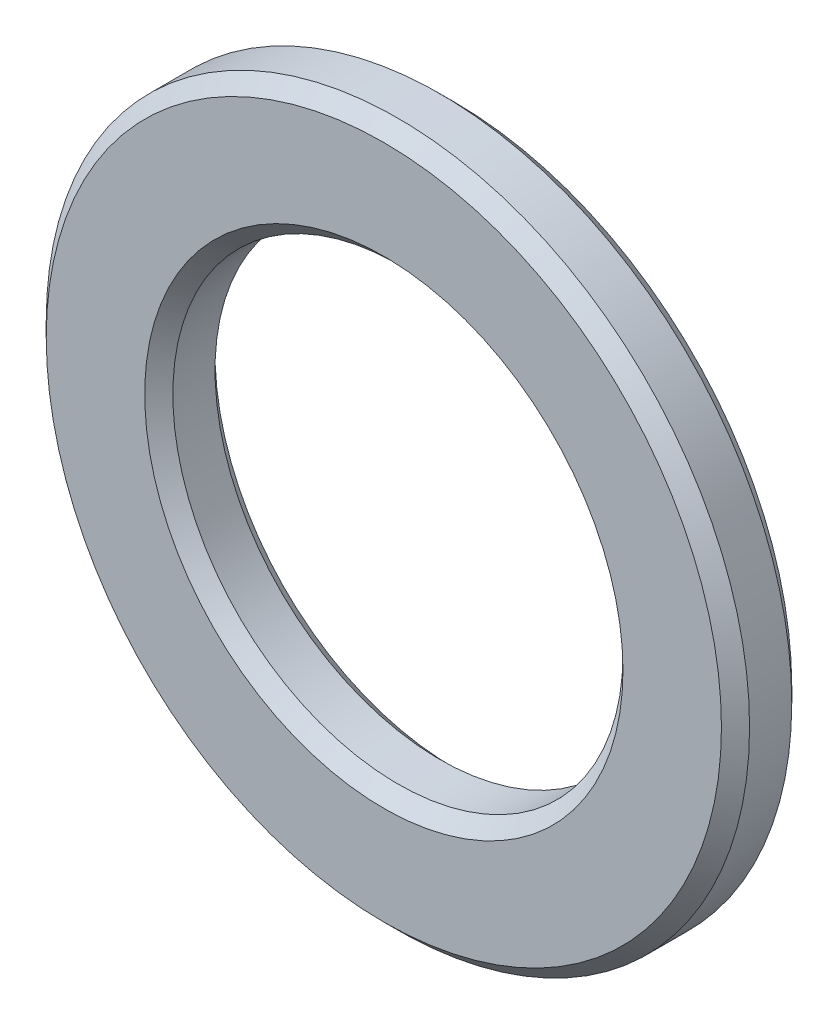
from build123d import *

# Parameters (mm, degrees)
SKETCH1_R           = 5
SKETCH1_R_2         = 3.2
BOSS_EXTRUDE2_DEPTH = 0.5
CHAMFER3_SIZE       = 0.2


with BuildPart() as part:
    # Sketch1 → Boss-Extrude2 (new, symmetric)
    with BuildSketch(Plane.XY):
        Circle(SKETCH1_R)
        Circle(SKETCH1_R_2, mode=Mode.SUBTRACT)
    extrude(amount=BOSS_EXTRUDE2_DEPTH, both=True)

    # Chamfer3
    chamfer3_edges = [part.edges().sort_by_distance(p)[0] for p in [
        (-5, 0, -0.5),
        (-5, 0, 0.5),
        (-3.2, 0, -0.5),
        (-3.2, 0, 0.5),
    ]]
    chamfer(chamfer3_edges, length=CHAMFER3_SIZE)


solid = part.part
